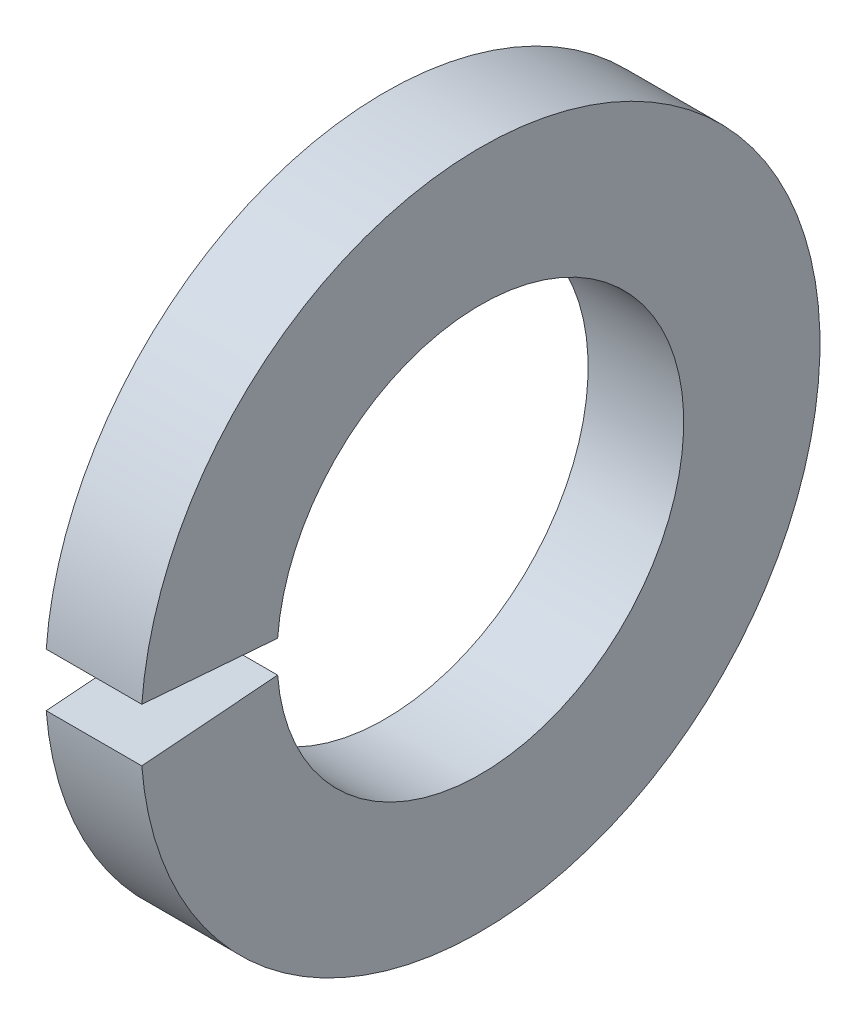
from build123d import *

# Parameters (mm, degrees)
SKETCH1_W = 1.1938
SKETCH1_H = 1.7018
GAP_DEPTH = 7.116444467


with BuildPart() as part:
    # Sketch1 → Base-Revolve (revolve)
    with BuildSketch(Plane.XY, mode=Mode.PRIVATE) as base_revolve_sk:
        with Locations((-0.5969, 3.3909)):
            Rectangle(SKETCH1_W, SKETCH1_H)
    revolve(base_revolve_sk.sketch.rotate(Axis((-34.925, 0, 0), (1, 0, 0)), 90), axis=Axis((-34.925, 0, 0), (1, 0, 0)))

    # Sketch2 → Gap (cut, through all)
    with BuildSketch(Plane(origin=(0, 0, 0), x_dir=(0, -1, 0), z_dir=(-1, 0, 0))):
        with BuildLine():
            Line((0, 0), (0.339463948, 4.313298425))
            ThreePointArc((0.339463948, 4.313298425), (0, 4.326636), (-0.339463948, 4.313298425))
            Line((-0.339463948, 4.313298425), (0, 0))
        make_face()
    extrude(amount=GAP_DEPTH, mode=Mode.SUBTRACT)


solid = part.part
